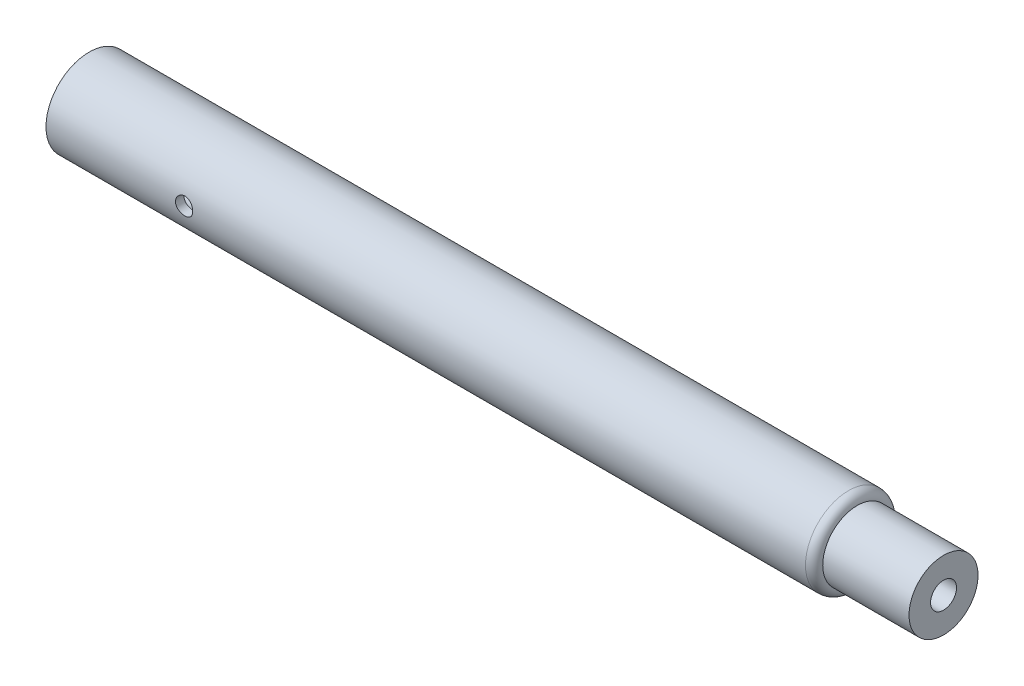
from build123d import *

# Parameters (mm, degrees)
CUT_EXTRUDE1_START      = -25.4
SKETCH4_R               = 2.3876
CUT_EXTRUDE1_DEPTH      = 25.4
CUT_EXTRUDE2_DEPTH      = 158.575541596
CUT_EXTRUDE2_DEPTH_BACK = 158.575541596
SKETCH5_R               = 1.5875


with BuildPart() as part:
    # Sketch3 → Base-Revolve (revolve)
    with BuildSketch(Plane.XY, mode=Mode.PRIVATE) as base_revolve_sk:
        with BuildLine():
            Line((0, 6.35), (0, 7.9375))
            Line((0, 7.9375), (139.7127, 7.9375))
            ThreePointArc((139.7127, 7.9375), (140.835232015, 7.472532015), (141.3002, 6.35))
            Line((141.3002, 6.35), (157.1752, 6.35))
            Line((157.1752, 6.35), (157.1752, 2.3876))
            Line((157.1752, 2.3876), (139.3952, 2.3876))
            Line((139.3952, 2.3876), (139.3952, 0))
            Line((139.3952, 0), (138.176, 0))
            Line((138.176, 0), (138.176, 4.7752))
            Line((138.176, 4.7752), (76.2, 4.7752))
            Line((76.2, 4.7752), (76.2, 6.35))
            Line((76.2, 6.35), (0, 6.35))
        make_face()
    revolve(base_revolve_sk.sketch.rotate(Axis((0, 0, 0), (1, 0, 0)), 90), axis=Axis((0, 0, 0), (1, 0, 0)))

    # Sketch4 → Cut-Extrude1 (cut)
    with BuildSketch(Plane(origin=(157.1752, 0, 0), x_dir=(0, 0, -1), z_dir=(1, 0, 0)).offset(CUT_EXTRUDE1_START)):
        with Locations(Location((0, 0, 0), (0, 0, 180))):
            Circle(SKETCH4_R)
    extrude(amount=CUT_EXTRUDE1_DEPTH, mode=Mode.SUBTRACT)

    # Sketch5 → Cut-Extrude2 (cut, two sides: drawn at the far end of the back side and taken through both)
    with BuildSketch(Plane.XY.offset(-CUT_EXTRUDE2_DEPTH_BACK)):
        with Locations((25.4, 0)):
            Circle(SKETCH5_R)
    extrude(amount=CUT_EXTRUDE2_DEPTH + CUT_EXTRUDE2_DEPTH_BACK, mode=Mode.SUBTRACT)


solid = part.part
